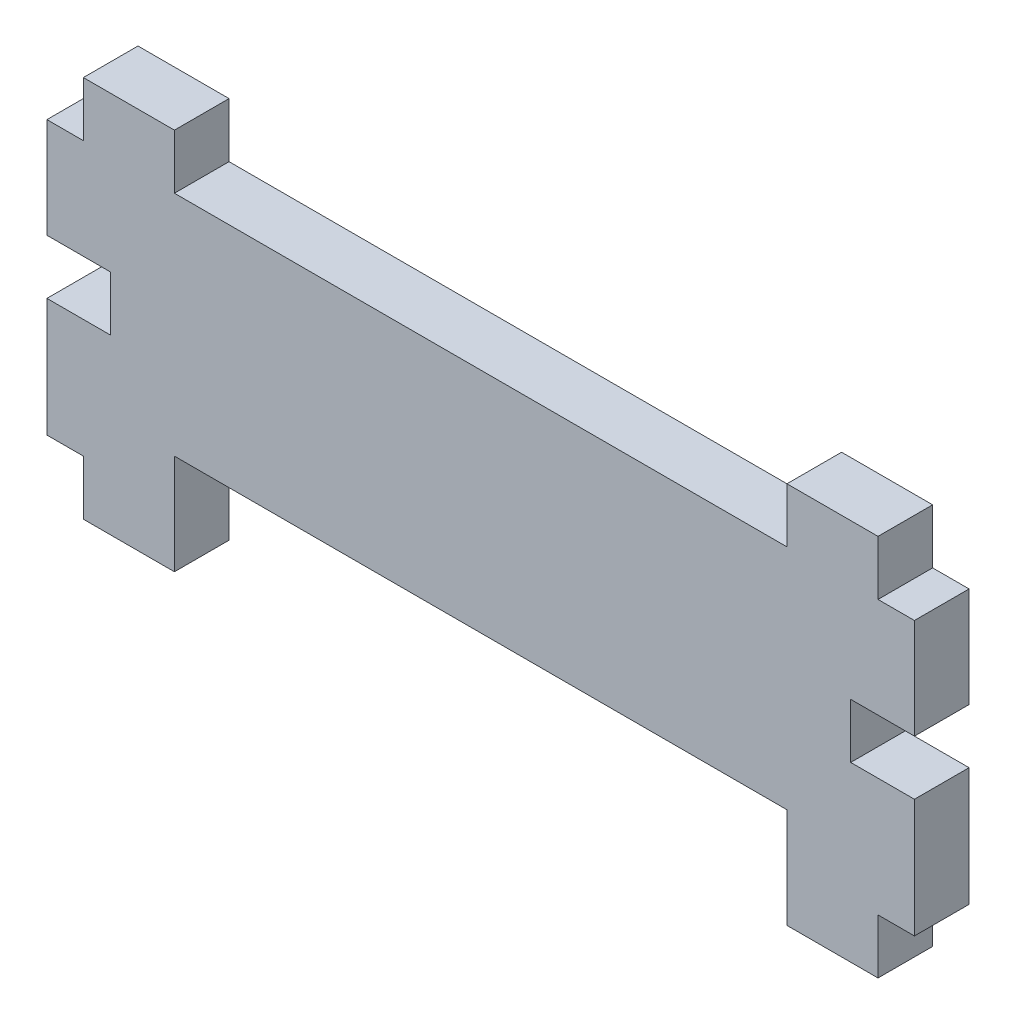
ISO-10303-21;
HEADER;
FILE_DESCRIPTION(('STEP AP214'),'2;1');
FILE_NAME('part.step','',(''),(''),'','','');
FILE_SCHEMA(('AUTOMOTIVE_DESIGN { 1 0 10303 214 1 1 1 1 }'));
ENDSEC;
DATA;
#1=APPLICATION_CONTEXT('core data for automotive mechanical design processes');
#2=APPLICATION_PROTOCOL_DEFINITION('international standard','automotive_design',2000,#1);
#3=PRODUCT_CONTEXT('',#1,'mechanical');
#4=PRODUCT('Part','Part','',(#3));
#5=PRODUCT_RELATED_PRODUCT_CATEGORY('part','',(#4));
#6=PRODUCT_DEFINITION_FORMATION('','',#4);
#7=PRODUCT_DEFINITION_CONTEXT('part definition',#1,'design');
#8=PRODUCT_DEFINITION('design','',#6,#7);
#9=PRODUCT_DEFINITION_SHAPE('','',#8);
#10=(LENGTH_UNIT() NAMED_UNIT(*) SI_UNIT(.MILLI.,.METRE.));
#11=(NAMED_UNIT(*) PLANE_ANGLE_UNIT() SI_UNIT($,.RADIAN.));
#12=(NAMED_UNIT(*) SI_UNIT($,.STERADIAN.) SOLID_ANGLE_UNIT());
#13=UNCERTAINTY_MEASURE_WITH_UNIT(LENGTH_MEASURE(1.E-05),#10,'distance_accuracy_value','');
#14=(GEOMETRIC_REPRESENTATION_CONTEXT(3) GLOBAL_UNCERTAINTY_ASSIGNED_CONTEXT((#13)) GLOBAL_UNIT_ASSIGNED_CONTEXT((#10,
#11,#12)) REPRESENTATION_CONTEXT('',''));
#15=CARTESIAN_POINT('',(0.,0.,0.));
#16=DIRECTION('',(0.,0.,1.));
#17=DIRECTION('',(1.,0.,0.));
#18=AXIS2_PLACEMENT_3D('',#15,#16,#17);
#19=CARTESIAN_POINT('',(35.0512616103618,-17.3140808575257,3.));
#20=DIRECTION('',(0.,1.,0.));
#21=DIRECTION('',(0.,0.,1.));
#22=AXIS2_PLACEMENT_3D('',#19,#20,#21);
#23=PLANE('',#22);
#24=DIRECTION('',(1.,0.,0.));
#25=VECTOR('',#24,1.);
#26=CARTESIAN_POINT('',(35.0512616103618,-17.3140808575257,0.));
#27=LINE('',#26,#25);
#28=CARTESIAN_POINT('',(33.0512616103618,-17.3140808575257,0.));
#29=VERTEX_POINT('',#28);
#30=CARTESIAN_POINT('',(35.0512616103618,-17.3140808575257,0.));
#31=VERTEX_POINT('',#30);
#32=EDGE_CURVE('E250',#29,#31,#27,.T.);
#33=ORIENTED_EDGE('',*,*,#32,.T.);
#34=DIRECTION('',(0.,0.,-1.));
#35=VECTOR('',#34,1.);
#36=CARTESIAN_POINT('',(35.0512616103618,-17.3140808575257,3.));
#37=LINE('',#36,#35);
#38=CARTESIAN_POINT('',(35.0512616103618,-17.3140808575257,3.));
#39=VERTEX_POINT('',#38);
#40=EDGE_CURVE('E11',#39,#31,#37,.T.);
#41=ORIENTED_EDGE('',*,*,#40,.F.);
#42=DIRECTION('',(1.,0.,0.));
#43=VECTOR('',#42,1.);
#44=CARTESIAN_POINT('',(35.0512616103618,-17.3140808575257,3.));
#45=LINE('',#44,#43);
#46=CARTESIAN_POINT('',(33.0512616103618,-17.3140808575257,3.));
#47=VERTEX_POINT('',#46);
#48=EDGE_CURVE('E306',#47,#39,#45,.T.);
#49=ORIENTED_EDGE('',*,*,#48,.F.);
#50=DIRECTION('',(0.,0.,-1.));
#51=VECTOR('',#50,1.);
#52=CARTESIAN_POINT('',(33.0512616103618,-17.3140808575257,3.));
#53=LINE('',#52,#51);
#54=EDGE_CURVE('E246',#47,#29,#53,.T.);
#55=ORIENTED_EDGE('',*,*,#54,.T.);
#56=EDGE_LOOP('',(#33,#41,#49,#55));
#57=FACE_BOUND('',#56,.T.);
#58=ADVANCED_FACE('F35',(#57),#23,.F.);
#59=CARTESIAN_POINT('',(35.0512616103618,-17.3140808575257,3.));
#60=DIRECTION('',(-1.,0.,0.));
#61=DIRECTION('',(0.,0.,1.));
#62=AXIS2_PLACEMENT_3D('',#59,#60,#61);
#63=PLANE('',#62);
#64=DIRECTION('',(0.,1.,0.));
#65=VECTOR('',#64,1.);
#66=CARTESIAN_POINT('',(35.0512616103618,-17.3140808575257,0.));
#67=LINE('',#66,#65);
#68=CARTESIAN_POINT('',(35.0512616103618,-10.8140808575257,0.));
#69=VERTEX_POINT('',#68);
#70=EDGE_CURVE('E253',#31,#69,#67,.T.);
#71=ORIENTED_EDGE('',*,*,#70,.T.);
#72=DIRECTION('',(0.,0.,-1.));
#73=VECTOR('',#72,1.);
#74=CARTESIAN_POINT('',(35.0512616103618,-10.8140808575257,3.));
#75=LINE('',#74,#73);
#76=CARTESIAN_POINT('',(35.0512616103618,-10.8140808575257,3.));
#77=VERTEX_POINT('',#76);
#78=EDGE_CURVE('E43',#77,#69,#75,.T.);
#79=ORIENTED_EDGE('',*,*,#78,.F.);
#80=DIRECTION('',(0.,1.,0.));
#81=VECTOR('',#80,1.);
#82=CARTESIAN_POINT('',(35.0512616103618,-17.3140808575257,3.));
#83=LINE('',#82,#81);
#84=EDGE_CURVE('E154',#39,#77,#83,.T.);
#85=ORIENTED_EDGE('',*,*,#84,.F.);
#86=ORIENTED_EDGE('',*,*,#40,.T.);
#87=EDGE_LOOP('',(#71,#79,#85,#86));
#88=FACE_BOUND('',#87,.T.);
#89=ADVANCED_FACE('F464',(#88),#63,.F.);
#90=CARTESIAN_POINT('',(35.0512616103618,-10.8140808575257,3.));
#91=DIRECTION('',(0.,-1.,0.));
#92=DIRECTION('',(0.,0.,-1.));
#93=AXIS2_PLACEMENT_3D('',#90,#91,#92);
#94=PLANE('',#93);
#95=DIRECTION('',(-1.,0.,0.));
#96=VECTOR('',#95,1.);
#97=CARTESIAN_POINT('',(35.0512616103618,-10.8140808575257,0.));
#98=LINE('',#97,#96);
#99=CARTESIAN_POINT('',(31.5512616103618,-10.8140808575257,0.));
#100=VERTEX_POINT('',#99);
#101=EDGE_CURVE('E255',#69,#100,#98,.T.);
#102=ORIENTED_EDGE('',*,*,#101,.T.);
#103=DIRECTION('',(0.,0.,-1.));
#104=VECTOR('',#103,1.);
#105=CARTESIAN_POINT('',(31.5512616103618,-10.8140808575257,3.));
#106=LINE('',#105,#104);
#107=CARTESIAN_POINT('',(31.5512616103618,-10.8140808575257,3.));
#108=VERTEX_POINT('',#107);
#109=EDGE_CURVE('E373',#108,#100,#106,.T.);
#110=ORIENTED_EDGE('',*,*,#109,.F.);
#111=DIRECTION('',(-1.,0.,0.));
#112=VECTOR('',#111,1.);
#113=CARTESIAN_POINT('',(35.0512616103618,-10.8140808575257,3.));
#114=LINE('',#113,#112);
#115=EDGE_CURVE('E381',#77,#108,#114,.T.);
#116=ORIENTED_EDGE('',*,*,#115,.F.);
#117=ORIENTED_EDGE('',*,*,#78,.T.);
#118=EDGE_LOOP('',(#102,#110,#116,#117));
#119=FACE_BOUND('',#118,.T.);
#120=ADVANCED_FACE('F379',(#119),#94,.F.);
#121=CARTESIAN_POINT('',(31.5512616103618,-10.8140808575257,3.));
#122=DIRECTION('',(-1.,0.,0.));
#123=DIRECTION('',(0.,0.,1.));
#124=AXIS2_PLACEMENT_3D('',#121,#122,#123);
#125=PLANE('',#124);
#126=DIRECTION('',(0.,1.,0.));
#127=VECTOR('',#126,1.);
#128=CARTESIAN_POINT('',(31.5512616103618,-10.8140808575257,0.));
#129=LINE('',#128,#127);
#130=CARTESIAN_POINT('',(31.5512616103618,-7.81408085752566,0.));
#131=VERTEX_POINT('',#130);
#132=EDGE_CURVE('E257',#100,#131,#129,.T.);
#133=ORIENTED_EDGE('',*,*,#132,.T.);
#134=DIRECTION('',(0.,0.,-1.));
#135=VECTOR('',#134,1.);
#136=CARTESIAN_POINT('',(31.5512616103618,-7.81408085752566,3.));
#137=LINE('',#136,#135);
#138=CARTESIAN_POINT('',(31.5512616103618,-7.81408085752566,3.));
#139=VERTEX_POINT('',#138);
#140=EDGE_CURVE('E370',#139,#131,#137,.T.);
#141=ORIENTED_EDGE('',*,*,#140,.F.);
#142=DIRECTION('',(0.,1.,0.));
#143=VECTOR('',#142,1.);
#144=CARTESIAN_POINT('',(31.5512616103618,-10.8140808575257,3.));
#145=LINE('',#144,#143);
#146=EDGE_CURVE('E399',#108,#139,#145,.T.);
#147=ORIENTED_EDGE('',*,*,#146,.F.);
#148=ORIENTED_EDGE('',*,*,#109,.T.);
#149=EDGE_LOOP('',(#133,#141,#147,#148));
#150=FACE_BOUND('',#149,.T.);
#151=ADVANCED_FACE('F390',(#150),#125,.F.);
#152=CARTESIAN_POINT('',(31.5512616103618,-7.81408085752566,3.));
#153=DIRECTION('',(0.,1.,0.));
#154=DIRECTION('',(0.,0.,1.));
#155=AXIS2_PLACEMENT_3D('',#152,#153,#154);
#156=PLANE('',#155);
#157=DIRECTION('',(1.,0.,0.));
#158=VECTOR('',#157,1.);
#159=CARTESIAN_POINT('',(31.5512616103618,-7.81408085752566,0.));
#160=LINE('',#159,#158);
#161=CARTESIAN_POINT('',(35.0512616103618,-7.81408085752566,0.));
#162=VERTEX_POINT('',#161);
#163=EDGE_CURVE('E259',#131,#162,#160,.T.);
#164=ORIENTED_EDGE('',*,*,#163,.T.);
#165=DIRECTION('',(0.,0.,-1.));
#166=VECTOR('',#165,1.);
#167=CARTESIAN_POINT('',(35.0512616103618,-7.81408085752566,3.));
#168=LINE('',#167,#166);
#169=CARTESIAN_POINT('',(35.0512616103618,-7.81408085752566,3.));
#170=VERTEX_POINT('',#169);
#171=EDGE_CURVE('E367',#170,#162,#168,.T.);
#172=ORIENTED_EDGE('',*,*,#171,.F.);
#173=DIRECTION('',(1.,0.,0.));
#174=VECTOR('',#173,1.);
#175=CARTESIAN_POINT('',(31.5512616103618,-7.81408085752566,3.));
#176=LINE('',#175,#174);
#177=EDGE_CURVE('E396',#139,#170,#176,.T.);
#178=ORIENTED_EDGE('',*,*,#177,.F.);
#179=ORIENTED_EDGE('',*,*,#140,.T.);
#180=EDGE_LOOP('',(#164,#172,#178,#179));
#181=FACE_BOUND('',#180,.T.);
#182=ADVANCED_FACE('F394',(#181),#156,.F.);
#183=CARTESIAN_POINT('',(35.0512616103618,-7.81408085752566,3.));
#184=DIRECTION('',(-1.,0.,0.));
#185=DIRECTION('',(0.,0.,1.));
#186=AXIS2_PLACEMENT_3D('',#183,#184,#185);
#187=PLANE('',#186);
#188=DIRECTION('',(0.,1.,0.));
#189=VECTOR('',#188,1.);
#190=CARTESIAN_POINT('',(35.0512616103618,-7.81408085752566,0.));
#191=LINE('',#190,#189);
#192=CARTESIAN_POINT('',(35.0512616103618,-2.31408085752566,0.));
#193=VERTEX_POINT('',#192);
#194=EDGE_CURVE('E261',#162,#193,#191,.T.);
#195=ORIENTED_EDGE('',*,*,#194,.T.);
#196=DIRECTION('',(0.,0.,-1.));
#197=VECTOR('',#196,1.);
#198=CARTESIAN_POINT('',(35.0512616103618,-2.31408085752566,3.));
#199=LINE('',#198,#197);
#200=CARTESIAN_POINT('',(35.0512616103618,-2.31408085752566,3.));
#201=VERTEX_POINT('',#200);
#202=EDGE_CURVE('E364',#201,#193,#199,.T.);
#203=ORIENTED_EDGE('',*,*,#202,.F.);
#204=DIRECTION('',(0.,1.,0.));
#205=VECTOR('',#204,1.);
#206=CARTESIAN_POINT('',(35.0512616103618,-7.81408085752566,3.));
#207=LINE('',#206,#205);
#208=EDGE_CURVE('E398',#170,#201,#207,.T.);
#209=ORIENTED_EDGE('',*,*,#208,.F.);
#210=ORIENTED_EDGE('',*,*,#171,.T.);
#211=EDGE_LOOP('',(#195,#203,#209,#210));
#212=FACE_BOUND('',#211,.T.);
#213=ADVANCED_FACE('F477',(#212),#187,.F.);
#214=CARTESIAN_POINT('',(33.0512616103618,-2.31408085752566,3.));
#215=DIRECTION('',(0.,-1.,0.));
#216=DIRECTION('',(0.,0.,-1.));
#217=AXIS2_PLACEMENT_3D('',#214,#215,#216);
#218=PLANE('',#217);
#219=DIRECTION('',(-1.,0.,0.));
#220=VECTOR('',#219,1.);
#221=CARTESIAN_POINT('',(33.0512616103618,-2.31408085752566,0.));
#222=LINE('',#221,#220);
#223=CARTESIAN_POINT('',(33.0512616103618,-2.31408085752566,0.));
#224=VERTEX_POINT('',#223);
#225=EDGE_CURVE('E263',#193,#224,#222,.T.);
#226=ORIENTED_EDGE('',*,*,#225,.T.);
#227=DIRECTION('',(0.,0.,-1.));
#228=VECTOR('',#227,1.);
#229=CARTESIAN_POINT('',(33.0512616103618,-2.31408085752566,3.));
#230=LINE('',#229,#228);
#231=CARTESIAN_POINT('',(33.0512616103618,-2.31408085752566,3.));
#232=VERTEX_POINT('',#231);
#233=EDGE_CURVE('E361',#232,#224,#230,.T.);
#234=ORIENTED_EDGE('',*,*,#233,.F.);
#235=DIRECTION('',(-1.,0.,0.));
#236=VECTOR('',#235,1.);
#237=CARTESIAN_POINT('',(33.0512616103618,-2.31408085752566,3.));
#238=LINE('',#237,#236);
#239=EDGE_CURVE('E401',#201,#232,#238,.T.);
#240=ORIENTED_EDGE('',*,*,#239,.F.);
#241=ORIENTED_EDGE('',*,*,#202,.T.);
#242=EDGE_LOOP('',(#226,#234,#240,#241));
#243=FACE_BOUND('',#242,.T.);
#244=ADVANCED_FACE('F480',(#243),#218,.F.);
#245=CARTESIAN_POINT('',(33.0512616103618,0.685919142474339,3.));
#246=DIRECTION('',(-1.,0.,0.));
#247=DIRECTION('',(0.,0.,1.));
#248=AXIS2_PLACEMENT_3D('',#245,#246,#247);
#249=PLANE('',#248);
#250=DIRECTION('',(0.,1.,0.));
#251=VECTOR('',#250,1.);
#252=CARTESIAN_POINT('',(33.0512616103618,0.685919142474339,0.));
#253=LINE('',#252,#251);
#254=CARTESIAN_POINT('',(33.0512616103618,0.685919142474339,0.));
#255=VERTEX_POINT('',#254);
#256=EDGE_CURVE('E265',#224,#255,#253,.T.);
#257=ORIENTED_EDGE('',*,*,#256,.T.);
#258=DIRECTION('',(0.,0.,-1.));
#259=VECTOR('',#258,1.);
#260=CARTESIAN_POINT('',(33.0512616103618,0.685919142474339,3.));
#261=LINE('',#260,#259);
#262=CARTESIAN_POINT('',(33.0512616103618,0.685919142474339,3.));
#263=VERTEX_POINT('',#262);
#264=EDGE_CURVE('E358',#263,#255,#261,.T.);
#265=ORIENTED_EDGE('',*,*,#264,.F.);
#266=DIRECTION('',(0.,1.,0.));
#267=VECTOR('',#266,1.);
#268=CARTESIAN_POINT('',(33.0512616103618,0.685919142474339,3.));
#269=LINE('',#268,#267);
#270=EDGE_CURVE('E407',#232,#263,#269,.T.);
#271=ORIENTED_EDGE('',*,*,#270,.F.);
#272=ORIENTED_EDGE('',*,*,#233,.T.);
#273=EDGE_LOOP('',(#257,#265,#271,#272));
#274=FACE_BOUND('',#273,.T.);
#275=ADVANCED_FACE('F484',(#274),#249,.F.);
#276=CARTESIAN_POINT('',(28.0512616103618,0.685919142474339,3.));
#277=DIRECTION('',(0.,-1.,0.));
#278=DIRECTION('',(0.,0.,-1.));
#279=AXIS2_PLACEMENT_3D('',#276,#277,#278);
#280=PLANE('',#279);
#281=DIRECTION('',(-1.,0.,0.));
#282=VECTOR('',#281,1.);
#283=CARTESIAN_POINT('',(28.0512616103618,0.685919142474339,0.));
#284=LINE('',#283,#282);
#285=CARTESIAN_POINT('',(28.0512616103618,0.685919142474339,0.));
#286=VERTEX_POINT('',#285);
#287=EDGE_CURVE('E267',#255,#286,#284,.T.);
#288=ORIENTED_EDGE('',*,*,#287,.T.);
#289=DIRECTION('',(0.,0.,-1.));
#290=VECTOR('',#289,1.);
#291=CARTESIAN_POINT('',(28.0512616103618,0.685919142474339,3.));
#292=LINE('',#291,#290);
#293=CARTESIAN_POINT('',(28.0512616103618,0.685919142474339,3.));
#294=VERTEX_POINT('',#293);
#295=EDGE_CURVE('E355',#294,#286,#292,.T.);
#296=ORIENTED_EDGE('',*,*,#295,.F.);
#297=DIRECTION('',(-1.,0.,0.));
#298=VECTOR('',#297,1.);
#299=CARTESIAN_POINT('',(28.0512616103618,0.685919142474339,3.));
#300=LINE('',#299,#298);
#301=EDGE_CURVE('E409',#263,#294,#300,.T.);
#302=ORIENTED_EDGE('',*,*,#301,.F.);
#303=ORIENTED_EDGE('',*,*,#264,.T.);
#304=EDGE_LOOP('',(#288,#296,#302,#303));
#305=FACE_BOUND('',#304,.T.);
#306=ADVANCED_FACE('F488',(#305),#280,.F.);
#307=CARTESIAN_POINT('',(28.0512616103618,-2.31408085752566,3.));
#308=DIRECTION('',(1.,0.,0.));
#309=DIRECTION('',(0.,0.,-1.));
#310=AXIS2_PLACEMENT_3D('',#307,#308,#309);
#311=PLANE('',#310);
#312=DIRECTION('',(0.,-1.,0.));
#313=VECTOR('',#312,1.);
#314=CARTESIAN_POINT('',(28.0512616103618,-2.31408085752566,0.));
#315=LINE('',#314,#313);
#316=CARTESIAN_POINT('',(28.0512616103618,-2.31408085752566,0.));
#317=VERTEX_POINT('',#316);
#318=EDGE_CURVE('E269',#286,#317,#315,.T.);
#319=ORIENTED_EDGE('',*,*,#318,.T.);
#320=DIRECTION('',(0.,0.,-1.));
#321=VECTOR('',#320,1.);
#322=CARTESIAN_POINT('',(28.0512616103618,-2.31408085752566,3.));
#323=LINE('',#322,#321);
#324=CARTESIAN_POINT('',(28.0512616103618,-2.31408085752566,3.));
#325=VERTEX_POINT('',#324);
#326=EDGE_CURVE('E352',#325,#317,#323,.T.);
#327=ORIENTED_EDGE('',*,*,#326,.F.);
#328=DIRECTION('',(0.,-1.,0.));
#329=VECTOR('',#328,1.);
#330=CARTESIAN_POINT('',(28.0512616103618,-2.31408085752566,3.));
#331=LINE('',#330,#329);
#332=EDGE_CURVE('E411',#294,#325,#331,.T.);
#333=ORIENTED_EDGE('',*,*,#332,.F.);
#334=ORIENTED_EDGE('',*,*,#295,.T.);
#335=EDGE_LOOP('',(#319,#327,#333,#334));
#336=FACE_BOUND('',#335,.T.);
#337=ADVANCED_FACE('F492',(#336),#311,.F.);
#338=CARTESIAN_POINT('',(28.0512616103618,-2.31408085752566,3.));
#339=DIRECTION('',(0.,-1.,0.));
#340=DIRECTION('',(0.,0.,-1.));
#341=AXIS2_PLACEMENT_3D('',#338,#339,#340);
#342=PLANE('',#341);
#343=DIRECTION('',(-1.,0.,0.));
#344=VECTOR('',#343,1.);
#345=CARTESIAN_POINT('',(28.0512616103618,-2.31408085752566,0.));
#346=LINE('',#345,#344);
#347=CARTESIAN_POINT('',(-5.57873838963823,-2.31408085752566,0.));
#348=VERTEX_POINT('',#347);
#349=EDGE_CURVE('E271',#317,#348,#346,.T.);
#350=ORIENTED_EDGE('',*,*,#349,.T.);
#351=DIRECTION('',(0.,0.,-1.));
#352=VECTOR('',#351,1.);
#353=CARTESIAN_POINT('',(-5.57873838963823,-2.31408085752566,3.));
#354=LINE('',#353,#352);
#355=CARTESIAN_POINT('',(-5.57873838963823,-2.31408085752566,3.));
#356=VERTEX_POINT('',#355);
#357=EDGE_CURVE('E349',#356,#348,#354,.T.);
#358=ORIENTED_EDGE('',*,*,#357,.F.);
#359=DIRECTION('',(-1.,0.,0.));
#360=VECTOR('',#359,1.);
#361=CARTESIAN_POINT('',(28.0512616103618,-2.31408085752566,3.));
#362=LINE('',#361,#360);
#363=EDGE_CURVE('E413',#325,#356,#362,.T.);
#364=ORIENTED_EDGE('',*,*,#363,.F.);
#365=ORIENTED_EDGE('',*,*,#326,.T.);
#366=EDGE_LOOP('',(#350,#358,#364,#365));
#367=FACE_BOUND('',#366,.T.);
#368=ADVANCED_FACE('F496',(#367),#342,.F.);
#369=CARTESIAN_POINT('',(-5.57873838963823,0.685919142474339,3.));
#370=DIRECTION('',(-1.,0.,0.));
#371=DIRECTION('',(0.,0.,1.));
#372=AXIS2_PLACEMENT_3D('',#369,#370,#371);
#373=PLANE('',#372);
#374=DIRECTION('',(0.,1.,0.));
#375=VECTOR('',#374,1.);
#376=CARTESIAN_POINT('',(-5.57873838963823,0.685919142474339,0.));
#377=LINE('',#376,#375);
#378=CARTESIAN_POINT('',(-5.57873838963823,0.685919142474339,0.));
#379=VERTEX_POINT('',#378);
#380=EDGE_CURVE('E273',#348,#379,#377,.T.);
#381=ORIENTED_EDGE('',*,*,#380,.T.);
#382=DIRECTION('',(0.,0.,-1.));
#383=VECTOR('',#382,1.);
#384=CARTESIAN_POINT('',(-5.57873838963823,0.685919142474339,3.));
#385=LINE('',#384,#383);
#386=CARTESIAN_POINT('',(-5.57873838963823,0.685919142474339,3.));
#387=VERTEX_POINT('',#386);
#388=EDGE_CURVE('E346',#387,#379,#385,.T.);
#389=ORIENTED_EDGE('',*,*,#388,.F.);
#390=DIRECTION('',(0.,1.,0.));
#391=VECTOR('',#390,1.);
#392=CARTESIAN_POINT('',(-5.57873838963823,0.685919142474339,3.));
#393=LINE('',#392,#391);
#394=EDGE_CURVE('E415',#356,#387,#393,.T.);
#395=ORIENTED_EDGE('',*,*,#394,.F.);
#396=ORIENTED_EDGE('',*,*,#357,.T.);
#397=EDGE_LOOP('',(#381,#389,#395,#396));
#398=FACE_BOUND('',#397,.T.);
#399=ADVANCED_FACE('F500',(#398),#373,.F.);
#400=CARTESIAN_POINT('',(-10.5787383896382,0.685919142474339,3.));
#401=DIRECTION('',(0.,-1.,0.));
#402=DIRECTION('',(0.,0.,-1.));
#403=AXIS2_PLACEMENT_3D('',#400,#401,#402);
#404=PLANE('',#403);
#405=DIRECTION('',(-1.,0.,0.));
#406=VECTOR('',#405,1.);
#407=CARTESIAN_POINT('',(-10.5787383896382,0.685919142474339,0.));
#408=LINE('',#407,#406);
#409=CARTESIAN_POINT('',(-10.5787383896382,0.685919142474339,0.));
#410=VERTEX_POINT('',#409);
#411=EDGE_CURVE('E275',#379,#410,#408,.T.);
#412=ORIENTED_EDGE('',*,*,#411,.T.);
#413=DIRECTION('',(0.,0.,-1.));
#414=VECTOR('',#413,1.);
#415=CARTESIAN_POINT('',(-10.5787383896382,0.685919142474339,3.));
#416=LINE('',#415,#414);
#417=CARTESIAN_POINT('',(-10.5787383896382,0.685919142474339,3.));
#418=VERTEX_POINT('',#417);
#419=EDGE_CURVE('E343',#418,#410,#416,.T.);
#420=ORIENTED_EDGE('',*,*,#419,.F.);
#421=DIRECTION('',(-1.,0.,0.));
#422=VECTOR('',#421,1.);
#423=CARTESIAN_POINT('',(-10.5787383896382,0.685919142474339,3.));
#424=LINE('',#423,#422);
#425=EDGE_CURVE('E417',#387,#418,#424,.T.);
#426=ORIENTED_EDGE('',*,*,#425,.F.);
#427=ORIENTED_EDGE('',*,*,#388,.T.);
#428=EDGE_LOOP('',(#412,#420,#426,#427));
#429=FACE_BOUND('',#428,.T.);
#430=ADVANCED_FACE('F504',(#429),#404,.F.);
#431=CARTESIAN_POINT('',(-10.5787383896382,-2.31408085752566,3.));
#432=DIRECTION('',(1.,0.,0.));
#433=DIRECTION('',(0.,0.,-1.));
#434=AXIS2_PLACEMENT_3D('',#431,#432,#433);
#435=PLANE('',#434);
#436=DIRECTION('',(0.,-1.,0.));
#437=VECTOR('',#436,1.);
#438=CARTESIAN_POINT('',(-10.5787383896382,-2.31408085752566,0.));
#439=LINE('',#438,#437);
#440=CARTESIAN_POINT('',(-10.5787383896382,-2.31408085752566,0.));
#441=VERTEX_POINT('',#440);
#442=EDGE_CURVE('E277',#410,#441,#439,.T.);
#443=ORIENTED_EDGE('',*,*,#442,.T.);
#444=DIRECTION('',(0.,0.,-1.));
#445=VECTOR('',#444,1.);
#446=CARTESIAN_POINT('',(-10.5787383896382,-2.31408085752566,3.));
#447=LINE('',#446,#445);
#448=CARTESIAN_POINT('',(-10.5787383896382,-2.31408085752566,3.));
#449=VERTEX_POINT('',#448);
#450=EDGE_CURVE('E340',#449,#441,#447,.T.);
#451=ORIENTED_EDGE('',*,*,#450,.F.);
#452=DIRECTION('',(0.,-1.,0.));
#453=VECTOR('',#452,1.);
#454=CARTESIAN_POINT('',(-10.5787383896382,-2.31408085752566,3.));
#455=LINE('',#454,#453);
#456=EDGE_CURVE('E419',#418,#449,#455,.T.);
#457=ORIENTED_EDGE('',*,*,#456,.F.);
#458=ORIENTED_EDGE('',*,*,#419,.T.);
#459=EDGE_LOOP('',(#443,#451,#457,#458));
#460=FACE_BOUND('',#459,.T.);
#461=ADVANCED_FACE('F508',(#460),#435,.F.);
#462=CARTESIAN_POINT('',(-10.5787383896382,-2.31408085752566,3.));
#463=DIRECTION('',(0.,-1.,0.));
#464=DIRECTION('',(0.,0.,-1.));
#465=AXIS2_PLACEMENT_3D('',#462,#463,#464);
#466=PLANE('',#465);
#467=DIRECTION('',(-1.,0.,0.));
#468=VECTOR('',#467,1.);
#469=CARTESIAN_POINT('',(-10.5787383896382,-2.31408085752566,0.));
#470=LINE('',#469,#468);
#471=CARTESIAN_POINT('',(-12.5787383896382,-2.31408085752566,0.));
#472=VERTEX_POINT('',#471);
#473=EDGE_CURVE('E279',#441,#472,#470,.T.);
#474=ORIENTED_EDGE('',*,*,#473,.T.);
#475=DIRECTION('',(0.,0.,-1.));
#476=VECTOR('',#475,1.);
#477=CARTESIAN_POINT('',(-12.5787383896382,-2.31408085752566,3.));
#478=LINE('',#477,#476);
#479=CARTESIAN_POINT('',(-12.5787383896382,-2.31408085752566,3.));
#480=VERTEX_POINT('',#479);
#481=EDGE_CURVE('E337',#480,#472,#478,.T.);
#482=ORIENTED_EDGE('',*,*,#481,.F.);
#483=DIRECTION('',(-1.,0.,0.));
#484=VECTOR('',#483,1.);
#485=CARTESIAN_POINT('',(-10.5787383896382,-2.31408085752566,3.));
#486=LINE('',#485,#484);
#487=EDGE_CURVE('E421',#449,#480,#486,.T.);
#488=ORIENTED_EDGE('',*,*,#487,.F.);
#489=ORIENTED_EDGE('',*,*,#450,.T.);
#490=EDGE_LOOP('',(#474,#482,#488,#489));
#491=FACE_BOUND('',#490,.T.);
#492=ADVANCED_FACE('F512',(#491),#466,.F.);
#493=CARTESIAN_POINT('',(-12.5787383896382,-7.81408085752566,3.));
#494=DIRECTION('',(1.,0.,0.));
#495=DIRECTION('',(0.,0.,-1.));
#496=AXIS2_PLACEMENT_3D('',#493,#494,#495);
#497=PLANE('',#496);
#498=DIRECTION('',(0.,-1.,0.));
#499=VECTOR('',#498,1.);
#500=CARTESIAN_POINT('',(-12.5787383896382,-7.81408085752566,0.));
#501=LINE('',#500,#499);
#502=CARTESIAN_POINT('',(-12.5787383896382,-7.81408085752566,0.));
#503=VERTEX_POINT('',#502);
#504=EDGE_CURVE('E281',#472,#503,#501,.T.);
#505=ORIENTED_EDGE('',*,*,#504,.T.);
#506=DIRECTION('',(0.,0.,-1.));
#507=VECTOR('',#506,1.);
#508=CARTESIAN_POINT('',(-12.5787383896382,-7.81408085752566,3.));
#509=LINE('',#508,#507);
#510=CARTESIAN_POINT('',(-12.5787383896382,-7.81408085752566,3.));
#511=VERTEX_POINT('',#510);
#512=EDGE_CURVE('E334',#511,#503,#509,.T.);
#513=ORIENTED_EDGE('',*,*,#512,.F.);
#514=DIRECTION('',(0.,-1.,0.));
#515=VECTOR('',#514,1.);
#516=CARTESIAN_POINT('',(-12.5787383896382,-7.81408085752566,3.));
#517=LINE('',#516,#515);
#518=EDGE_CURVE('E423',#480,#511,#517,.T.);
#519=ORIENTED_EDGE('',*,*,#518,.F.);
#520=ORIENTED_EDGE('',*,*,#481,.T.);
#521=EDGE_LOOP('',(#505,#513,#519,#520));
#522=FACE_BOUND('',#521,.T.);
#523=ADVANCED_FACE('F516',(#522),#497,.F.);
#524=CARTESIAN_POINT('',(-9.07873838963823,-7.81408085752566,3.));
#525=DIRECTION('',(0.,1.,0.));
#526=DIRECTION('',(0.,0.,1.));
#527=AXIS2_PLACEMENT_3D('',#524,#525,#526);
#528=PLANE('',#527);
#529=DIRECTION('',(1.,0.,0.));
#530=VECTOR('',#529,1.);
#531=CARTESIAN_POINT('',(-9.07873838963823,-7.81408085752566,0.));
#532=LINE('',#531,#530);
#533=CARTESIAN_POINT('',(-9.07873838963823,-7.81408085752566,0.));
#534=VERTEX_POINT('',#533);
#535=EDGE_CURVE('E283',#503,#534,#532,.T.);
#536=ORIENTED_EDGE('',*,*,#535,.T.);
#537=DIRECTION('',(0.,0.,-1.));
#538=VECTOR('',#537,1.);
#539=CARTESIAN_POINT('',(-9.07873838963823,-7.81408085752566,3.));
#540=LINE('',#539,#538);
#541=CARTESIAN_POINT('',(-9.07873838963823,-7.81408085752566,3.));
#542=VERTEX_POINT('',#541);
#543=EDGE_CURVE('E331',#542,#534,#540,.T.);
#544=ORIENTED_EDGE('',*,*,#543,.F.);
#545=DIRECTION('',(1.,0.,0.));
#546=VECTOR('',#545,1.);
#547=CARTESIAN_POINT('',(-9.07873838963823,-7.81408085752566,3.));
#548=LINE('',#547,#546);
#549=EDGE_CURVE('E425',#511,#542,#548,.T.);
#550=ORIENTED_EDGE('',*,*,#549,.F.);
#551=ORIENTED_EDGE('',*,*,#512,.T.);
#552=EDGE_LOOP('',(#536,#544,#550,#551));
#553=FACE_BOUND('',#552,.T.);
#554=ADVANCED_FACE('F520',(#553),#528,.F.);
#555=CARTESIAN_POINT('',(-9.07873838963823,-10.8140808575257,3.));
#556=DIRECTION('',(1.,0.,0.));
#557=DIRECTION('',(0.,0.,-1.));
#558=AXIS2_PLACEMENT_3D('',#555,#556,#557);
#559=PLANE('',#558);
#560=DIRECTION('',(0.,-1.,0.));
#561=VECTOR('',#560,1.);
#562=CARTESIAN_POINT('',(-9.07873838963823,-10.8140808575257,0.));
#563=LINE('',#562,#561);
#564=CARTESIAN_POINT('',(-9.07873838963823,-10.8140808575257,0.));
#565=VERTEX_POINT('',#564);
#566=EDGE_CURVE('E285',#534,#565,#563,.T.);
#567=ORIENTED_EDGE('',*,*,#566,.T.);
#568=DIRECTION('',(0.,0.,-1.));
#569=VECTOR('',#568,1.);
#570=CARTESIAN_POINT('',(-9.07873838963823,-10.8140808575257,3.));
#571=LINE('',#570,#569);
#572=CARTESIAN_POINT('',(-9.07873838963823,-10.8140808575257,3.));
#573=VERTEX_POINT('',#572);
#574=EDGE_CURVE('E328',#573,#565,#571,.T.);
#575=ORIENTED_EDGE('',*,*,#574,.F.);
#576=DIRECTION('',(0.,-1.,0.));
#577=VECTOR('',#576,1.);
#578=CARTESIAN_POINT('',(-9.07873838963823,-10.8140808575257,3.));
#579=LINE('',#578,#577);
#580=EDGE_CURVE('E427',#542,#573,#579,.T.);
#581=ORIENTED_EDGE('',*,*,#580,.F.);
#582=ORIENTED_EDGE('',*,*,#543,.T.);
#583=EDGE_LOOP('',(#567,#575,#581,#582));
#584=FACE_BOUND('',#583,.T.);
#585=ADVANCED_FACE('F524',(#584),#559,.F.);
#586=CARTESIAN_POINT('',(-12.5787383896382,-10.8140808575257,3.));
#587=DIRECTION('',(0.,-1.,0.));
#588=DIRECTION('',(0.,0.,-1.));
#589=AXIS2_PLACEMENT_3D('',#586,#587,#588);
#590=PLANE('',#589);
#591=DIRECTION('',(-1.,0.,0.));
#592=VECTOR('',#591,1.);
#593=CARTESIAN_POINT('',(-12.5787383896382,-10.8140808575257,0.));
#594=LINE('',#593,#592);
#595=CARTESIAN_POINT('',(-12.5787383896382,-10.8140808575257,0.));
#596=VERTEX_POINT('',#595);
#597=EDGE_CURVE('E287',#565,#596,#594,.T.);
#598=ORIENTED_EDGE('',*,*,#597,.T.);
#599=DIRECTION('',(0.,0.,-1.));
#600=VECTOR('',#599,1.);
#601=CARTESIAN_POINT('',(-12.5787383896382,-10.8140808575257,3.));
#602=LINE('',#601,#600);
#603=CARTESIAN_POINT('',(-12.5787383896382,-10.8140808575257,3.));
#604=VERTEX_POINT('',#603);
#605=EDGE_CURVE('E325',#604,#596,#602,.T.);
#606=ORIENTED_EDGE('',*,*,#605,.F.);
#607=DIRECTION('',(-1.,0.,0.));
#608=VECTOR('',#607,1.);
#609=CARTESIAN_POINT('',(-12.5787383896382,-10.8140808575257,3.));
#610=LINE('',#609,#608);
#611=EDGE_CURVE('E429',#573,#604,#610,.T.);
#612=ORIENTED_EDGE('',*,*,#611,.F.);
#613=ORIENTED_EDGE('',*,*,#574,.T.);
#614=EDGE_LOOP('',(#598,#606,#612,#613));
#615=FACE_BOUND('',#614,.T.);
#616=ADVANCED_FACE('F528',(#615),#590,.F.);
#617=CARTESIAN_POINT('',(-12.5787383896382,-17.3140808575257,3.));
#618=DIRECTION('',(1.,0.,0.));
#619=DIRECTION('',(0.,1.,0.));
#620=AXIS2_PLACEMENT_3D('',#617,#618,#619);
#621=PLANE('',#620);
#622=DIRECTION('',(0.,-1.,0.));
#623=VECTOR('',#622,1.);
#624=CARTESIAN_POINT('',(-12.5787383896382,-17.3140808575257,0.));
#625=LINE('',#624,#623);
#626=CARTESIAN_POINT('',(-12.5787383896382,-17.3140808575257,0.));
#627=VERTEX_POINT('',#626);
#628=EDGE_CURVE('E289',#596,#627,#625,.T.);
#629=ORIENTED_EDGE('',*,*,#628,.T.);
#630=DIRECTION('',(0.,0.,-1.));
#631=VECTOR('',#630,1.);
#632=CARTESIAN_POINT('',(-12.5787383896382,-17.3140808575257,3.));
#633=LINE('',#632,#631);
#634=CARTESIAN_POINT('',(-12.5787383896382,-17.3140808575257,3.));
#635=VERTEX_POINT('',#634);
#636=EDGE_CURVE('E322',#635,#627,#633,.T.);
#637=ORIENTED_EDGE('',*,*,#636,.F.);
#638=DIRECTION('',(0.,-1.,0.));
#639=VECTOR('',#638,1.);
#640=CARTESIAN_POINT('',(-12.5787383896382,-17.3140808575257,3.));
#641=LINE('',#640,#639);
#642=EDGE_CURVE('E431',#604,#635,#641,.T.);
#643=ORIENTED_EDGE('',*,*,#642,.F.);
#644=ORIENTED_EDGE('',*,*,#605,.T.);
#645=EDGE_LOOP('',(#629,#637,#643,#644));
#646=FACE_BOUND('',#645,.T.);
#647=ADVANCED_FACE('F532',(#646),#621,.F.);
#648=CARTESIAN_POINT('',(-12.5787383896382,-17.3140808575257,3.));
#649=DIRECTION('',(0.,1.,0.));
#650=DIRECTION('',(0.,0.,1.));
#651=AXIS2_PLACEMENT_3D('',#648,#649,#650);
#652=PLANE('',#651);
#653=DIRECTION('',(1.,0.,0.));
#654=VECTOR('',#653,1.);
#655=CARTESIAN_POINT('',(-12.5787383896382,-17.3140808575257,0.));
#656=LINE('',#655,#654);
#657=CARTESIAN_POINT('',(-10.5787383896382,-17.3140808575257,0.));
#658=VERTEX_POINT('',#657);
#659=EDGE_CURVE('E291',#627,#658,#656,.T.);
#660=ORIENTED_EDGE('',*,*,#659,.T.);
#661=DIRECTION('',(0.,0.,-1.));
#662=VECTOR('',#661,1.);
#663=CARTESIAN_POINT('',(-10.5787383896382,-17.3140808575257,3.));
#664=LINE('',#663,#662);
#665=CARTESIAN_POINT('',(-10.5787383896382,-17.3140808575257,3.));
#666=VERTEX_POINT('',#665);
#667=EDGE_CURVE('E319',#666,#658,#664,.T.);
#668=ORIENTED_EDGE('',*,*,#667,.F.);
#669=DIRECTION('',(1.,0.,0.));
#670=VECTOR('',#669,1.);
#671=CARTESIAN_POINT('',(-12.5787383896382,-17.3140808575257,3.));
#672=LINE('',#671,#670);
#673=EDGE_CURVE('E433',#635,#666,#672,.T.);
#674=ORIENTED_EDGE('',*,*,#673,.F.);
#675=ORIENTED_EDGE('',*,*,#636,.T.);
#676=EDGE_LOOP('',(#660,#668,#674,#675));
#677=FACE_BOUND('',#676,.T.);
#678=ADVANCED_FACE('F536',(#677),#652,.F.);
#679=CARTESIAN_POINT('',(-10.5787383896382,-17.3140808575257,3.));
#680=DIRECTION('',(1.,0.,0.));
#681=DIRECTION('',(0.,0.,-1.));
#682=AXIS2_PLACEMENT_3D('',#679,#680,#681);
#683=PLANE('',#682);
#684=DIRECTION('',(0.,-1.,0.));
#685=VECTOR('',#684,1.);
#686=CARTESIAN_POINT('',(-10.5787383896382,-17.3140808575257,0.));
#687=LINE('',#686,#685);
#688=CARTESIAN_POINT('',(-10.5787383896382,-20.3140808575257,0.));
#689=VERTEX_POINT('',#688);
#690=EDGE_CURVE('E293',#658,#689,#687,.T.);
#691=ORIENTED_EDGE('',*,*,#690,.T.);
#692=DIRECTION('',(0.,0.,-1.));
#693=VECTOR('',#692,1.);
#694=CARTESIAN_POINT('',(-10.5787383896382,-20.3140808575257,3.));
#695=LINE('',#694,#693);
#696=CARTESIAN_POINT('',(-10.5787383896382,-20.3140808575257,3.));
#697=VERTEX_POINT('',#696);
#698=EDGE_CURVE('E316',#697,#689,#695,.T.);
#699=ORIENTED_EDGE('',*,*,#698,.F.);
#700=DIRECTION('',(0.,-1.,0.));
#701=VECTOR('',#700,1.);
#702=CARTESIAN_POINT('',(-10.5787383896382,-17.3140808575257,3.));
#703=LINE('',#702,#701);
#704=EDGE_CURVE('E435',#666,#697,#703,.T.);
#705=ORIENTED_EDGE('',*,*,#704,.F.);
#706=ORIENTED_EDGE('',*,*,#667,.T.);
#707=EDGE_LOOP('',(#691,#699,#705,#706));
#708=FACE_BOUND('',#707,.T.);
#709=ADVANCED_FACE('F540',(#708),#683,.F.);
#710=CARTESIAN_POINT('',(-10.5787383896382,-20.3140808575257,3.));
#711=DIRECTION('',(0.,1.,0.));
#712=DIRECTION('',(0.,0.,1.));
#713=AXIS2_PLACEMENT_3D('',#710,#711,#712);
#714=PLANE('',#713);
#715=DIRECTION('',(1.,0.,0.));
#716=VECTOR('',#715,1.);
#717=CARTESIAN_POINT('',(-10.5787383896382,-20.3140808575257,0.));
#718=LINE('',#717,#716);
#719=CARTESIAN_POINT('',(-5.57873838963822,-20.3140808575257,0.));
#720=VERTEX_POINT('',#719);
#721=EDGE_CURVE('E295',#689,#720,#718,.T.);
#722=ORIENTED_EDGE('',*,*,#721,.T.);
#723=DIRECTION('',(0.,0.,-1.));
#724=VECTOR('',#723,1.);
#725=CARTESIAN_POINT('',(-5.57873838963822,-20.3140808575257,3.));
#726=LINE('',#725,#724);
#727=CARTESIAN_POINT('',(-5.57873838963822,-20.3140808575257,3.));
#728=VERTEX_POINT('',#727);
#729=EDGE_CURVE('E313',#728,#720,#726,.T.);
#730=ORIENTED_EDGE('',*,*,#729,.F.);
#731=DIRECTION('',(1.,0.,0.));
#732=VECTOR('',#731,1.);
#733=CARTESIAN_POINT('',(-10.5787383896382,-20.3140808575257,3.));
#734=LINE('',#733,#732);
#735=EDGE_CURVE('E437',#697,#728,#734,.T.);
#736=ORIENTED_EDGE('',*,*,#735,.F.);
#737=ORIENTED_EDGE('',*,*,#698,.T.);
#738=EDGE_LOOP('',(#722,#730,#736,#737));
#739=FACE_BOUND('',#738,.T.);
#740=ADVANCED_FACE('F544',(#739),#714,.F.);
#741=CARTESIAN_POINT('',(-5.57873838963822,-17.3140808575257,3.));
#742=DIRECTION('',(-1.,0.,0.));
#743=DIRECTION('',(0.,0.,1.));
#744=AXIS2_PLACEMENT_3D('',#741,#742,#743);
#745=PLANE('',#744);
#746=DIRECTION('',(0.,1.,0.));
#747=VECTOR('',#746,1.);
#748=CARTESIAN_POINT('',(-5.57873838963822,-17.3140808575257,0.));
#749=LINE('',#748,#747);
#750=CARTESIAN_POINT('',(-5.57873838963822,-14.8140808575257,0.));
#751=VERTEX_POINT('',#750);
#752=EDGE_CURVE('E298',#720,#751,#749,.T.);
#753=ORIENTED_EDGE('',*,*,#752,.T.);
#754=DIRECTION('',(0.,0.,-1.));
#755=VECTOR('',#754,1.);
#756=CARTESIAN_POINT('',(-5.57873838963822,-14.8140808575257,3.));
#757=LINE('',#756,#755);
#758=CARTESIAN_POINT('',(-5.57873838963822,-14.8140808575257,3.));
#759=VERTEX_POINT('',#758);
#760=EDGE_CURVE('E310',#759,#751,#757,.T.);
#761=ORIENTED_EDGE('',*,*,#760,.F.);
#762=DIRECTION('',(0.,1.,0.));
#763=VECTOR('',#762,1.);
#764=CARTESIAN_POINT('',(-5.57873838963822,-20.3140808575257,3.));
#765=LINE('',#764,#763);
#766=EDGE_CURVE('E439',#728,#759,#765,.T.);
#767=ORIENTED_EDGE('',*,*,#766,.F.);
#768=ORIENTED_EDGE('',*,*,#729,.T.);
#769=EDGE_LOOP('',(#753,#761,#767,#768));
#770=FACE_BOUND('',#769,.T.);
#771=ADVANCED_FACE('F445',(#770),#745,.F.);
#772=CARTESIAN_POINT('',(28.0512616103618,-14.8140808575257,3.));
#773=DIRECTION('',(0.,1.,0.));
#774=DIRECTION('',(0.,0.,1.));
#775=AXIS2_PLACEMENT_3D('',#772,#773,#774);
#776=PLANE('',#775);
#777=DIRECTION('',(1.,0.,0.));
#778=VECTOR('',#777,1.);
#779=CARTESIAN_POINT('',(28.0512616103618,-14.8140808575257,0.));
#780=LINE('',#779,#778);
#781=CARTESIAN_POINT('',(28.0512616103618,-14.8140808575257,0.));
#782=VERTEX_POINT('',#781);
#783=EDGE_CURVE('E300',#751,#782,#780,.T.);
#784=ORIENTED_EDGE('',*,*,#783,.T.);
#785=DIRECTION('',(0.,0.,-1.));
#786=VECTOR('',#785,1.);
#787=CARTESIAN_POINT('',(28.0512616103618,-14.8140808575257,3.));
#788=LINE('',#787,#786);
#789=CARTESIAN_POINT('',(28.0512616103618,-14.8140808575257,3.));
#790=VERTEX_POINT('',#789);
#791=EDGE_CURVE('E241',#790,#782,#788,.T.);
#792=ORIENTED_EDGE('',*,*,#791,.F.);
#793=DIRECTION('',(1.,0.,0.));
#794=VECTOR('',#793,1.);
#795=CARTESIAN_POINT('',(28.0512616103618,-14.8140808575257,3.));
#796=LINE('',#795,#794);
#797=EDGE_CURVE('E233',#759,#790,#796,.T.);
#798=ORIENTED_EDGE('',*,*,#797,.F.);
#799=ORIENTED_EDGE('',*,*,#760,.T.);
#800=EDGE_LOOP('',(#784,#792,#798,#799));
#801=FACE_BOUND('',#800,.T.);
#802=ADVANCED_FACE('F448',(#801),#776,.F.);
#803=CARTESIAN_POINT('',(28.0512616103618,-17.3140808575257,3.));
#804=DIRECTION('',(1.,0.,0.));
#805=DIRECTION('',(0.,0.,-1.));
#806=AXIS2_PLACEMENT_3D('',#803,#804,#805);
#807=PLANE('',#806);
#808=DIRECTION('',(0.,-1.,0.));
#809=VECTOR('',#808,1.);
#810=CARTESIAN_POINT('',(28.0512616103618,-17.3140808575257,0.));
#811=LINE('',#810,#809);
#812=CARTESIAN_POINT('',(28.0512616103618,-20.3140808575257,0.));
#813=VERTEX_POINT('',#812);
#814=EDGE_CURVE('E240',#782,#813,#811,.T.);
#815=ORIENTED_EDGE('',*,*,#814,.T.);
#816=DIRECTION('',(0.,0.,-1.));
#817=VECTOR('',#816,1.);
#818=CARTESIAN_POINT('',(28.0512616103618,-20.3140808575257,3.));
#819=LINE('',#818,#817);
#820=CARTESIAN_POINT('',(28.0512616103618,-20.3140808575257,3.));
#821=VERTEX_POINT('',#820);
#822=EDGE_CURVE('E238',#821,#813,#819,.T.);
#823=ORIENTED_EDGE('',*,*,#822,.F.);
#824=DIRECTION('',(0.,-1.,0.));
#825=VECTOR('',#824,1.);
#826=CARTESIAN_POINT('',(28.0512616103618,-17.3140808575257,3.));
#827=LINE('',#826,#825);
#828=EDGE_CURVE('E227',#790,#821,#827,.T.);
#829=ORIENTED_EDGE('',*,*,#828,.F.);
#830=ORIENTED_EDGE('',*,*,#791,.T.);
#831=EDGE_LOOP('',(#815,#823,#829,#830));
#832=FACE_BOUND('',#831,.T.);
#833=ADVANCED_FACE('F239',(#832),#807,.F.);
#834=CARTESIAN_POINT('',(28.0512616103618,-20.3140808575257,3.));
#835=DIRECTION('',(0.,1.,0.));
#836=DIRECTION('',(0.,0.,1.));
#837=AXIS2_PLACEMENT_3D('',#834,#835,#836);
#838=PLANE('',#837);
#839=DIRECTION('',(1.,0.,0.));
#840=VECTOR('',#839,1.);
#841=CARTESIAN_POINT('',(28.0512616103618,-20.3140808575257,0.));
#842=LINE('',#841,#840);
#843=CARTESIAN_POINT('',(33.0512616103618,-20.3140808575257,0.));
#844=VERTEX_POINT('',#843);
#845=EDGE_CURVE('E140',#813,#844,#842,.T.);
#846=ORIENTED_EDGE('',*,*,#845,.T.);
#847=DIRECTION('',(0.,0.,-1.));
#848=VECTOR('',#847,1.);
#849=CARTESIAN_POINT('',(33.0512616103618,-20.3140808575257,3.));
#850=LINE('',#849,#848);
#851=CARTESIAN_POINT('',(33.0512616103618,-20.3140808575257,3.));
#852=VERTEX_POINT('',#851);
#853=EDGE_CURVE('E242',#852,#844,#850,.T.);
#854=ORIENTED_EDGE('',*,*,#853,.F.);
#855=DIRECTION('',(1.,0.,0.));
#856=VECTOR('',#855,1.);
#857=CARTESIAN_POINT('',(28.0512616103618,-20.3140808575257,3.));
#858=LINE('',#857,#856);
#859=EDGE_CURVE('E231',#821,#852,#858,.T.);
#860=ORIENTED_EDGE('',*,*,#859,.F.);
#861=ORIENTED_EDGE('',*,*,#822,.T.);
#862=EDGE_LOOP('',(#846,#854,#860,#861));
#863=FACE_BOUND('',#862,.T.);
#864=ADVANCED_FACE('F244',(#863),#838,.F.);
#865=CARTESIAN_POINT('',(33.0512616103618,-20.3140808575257,3.));
#866=DIRECTION('',(-1.,0.,0.));
#867=DIRECTION('',(0.,0.,1.));
#868=AXIS2_PLACEMENT_3D('',#865,#866,#867);
#869=PLANE('',#868);
#870=DIRECTION('',(0.,1.,0.));
#871=VECTOR('',#870,1.);
#872=CARTESIAN_POINT('',(33.0512616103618,-20.3140808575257,0.));
#873=LINE('',#872,#871);
#874=EDGE_CURVE('E146',#844,#29,#873,.T.);
#875=ORIENTED_EDGE('',*,*,#874,.T.);
#876=ORIENTED_EDGE('',*,*,#54,.F.);
#877=DIRECTION('',(0.,1.,0.));
#878=VECTOR('',#877,1.);
#879=CARTESIAN_POINT('',(33.0512616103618,-20.3140808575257,3.));
#880=LINE('',#879,#878);
#881=EDGE_CURVE('E51',#852,#47,#880,.T.);
#882=ORIENTED_EDGE('',*,*,#881,.F.);
#883=ORIENTED_EDGE('',*,*,#853,.T.);
#884=EDGE_LOOP('',(#875,#876,#882,#883));
#885=FACE_BOUND('',#884,.T.);
#886=ADVANCED_FACE('F453',(#885),#869,.F.);
#887=CARTESIAN_POINT('',(0.,0.,3.));
#888=DIRECTION('',(0.,0.,-1.));
#889=DIRECTION('',(-1.,0.,0.));
#890=AXIS2_PLACEMENT_3D('',#887,#888,#889);
#891=PLANE('',#890);
#892=ORIENTED_EDGE('',*,*,#48,.T.);
#893=ORIENTED_EDGE('',*,*,#84,.T.);
#894=ORIENTED_EDGE('',*,*,#115,.T.);
#895=ORIENTED_EDGE('',*,*,#146,.T.);
#896=ORIENTED_EDGE('',*,*,#177,.T.);
#897=ORIENTED_EDGE('',*,*,#208,.T.);
#898=ORIENTED_EDGE('',*,*,#239,.T.);
#899=ORIENTED_EDGE('',*,*,#270,.T.);
#900=ORIENTED_EDGE('',*,*,#301,.T.);
#901=ORIENTED_EDGE('',*,*,#332,.T.);
#902=ORIENTED_EDGE('',*,*,#363,.T.);
#903=ORIENTED_EDGE('',*,*,#394,.T.);
#904=ORIENTED_EDGE('',*,*,#425,.T.);
#905=ORIENTED_EDGE('',*,*,#456,.T.);
#906=ORIENTED_EDGE('',*,*,#487,.T.);
#907=ORIENTED_EDGE('',*,*,#518,.T.);
#908=ORIENTED_EDGE('',*,*,#549,.T.);
#909=ORIENTED_EDGE('',*,*,#580,.T.);
#910=ORIENTED_EDGE('',*,*,#611,.T.);
#911=ORIENTED_EDGE('',*,*,#642,.T.);
#912=ORIENTED_EDGE('',*,*,#673,.T.);
#913=ORIENTED_EDGE('',*,*,#704,.T.);
#914=ORIENTED_EDGE('',*,*,#735,.T.);
#915=ORIENTED_EDGE('',*,*,#766,.T.);
#916=ORIENTED_EDGE('',*,*,#797,.T.);
#917=ORIENTED_EDGE('',*,*,#828,.T.);
#918=ORIENTED_EDGE('',*,*,#859,.T.);
#919=ORIENTED_EDGE('',*,*,#881,.T.);
#920=EDGE_LOOP('',(#892,#893,#894,#895,#896,#897,#898,#899,#900,#901,#902,#903,#904,#905,#906,
#907,#908,#909,#910,#911,#912,#913,#914,#915,#916,#917,#918,#919));
#921=FACE_BOUND('',#920,.T.);
#922=ADVANCED_FACE('F229',(#921),#891,.F.);
#923=CARTESIAN_POINT('',(0.,0.,0.));
#924=DIRECTION('',(0.,0.,-1.));
#925=DIRECTION('',(-1.,0.,0.));
#926=AXIS2_PLACEMENT_3D('',#923,#924,#925);
#927=PLANE('',#926);
#928=ORIENTED_EDGE('',*,*,#32,.F.);
#929=ORIENTED_EDGE('',*,*,#874,.F.);
#930=ORIENTED_EDGE('',*,*,#845,.F.);
#931=ORIENTED_EDGE('',*,*,#814,.F.);
#932=ORIENTED_EDGE('',*,*,#783,.F.);
#933=ORIENTED_EDGE('',*,*,#752,.F.);
#934=ORIENTED_EDGE('',*,*,#721,.F.);
#935=ORIENTED_EDGE('',*,*,#690,.F.);
#936=ORIENTED_EDGE('',*,*,#659,.F.);
#937=ORIENTED_EDGE('',*,*,#628,.F.);
#938=ORIENTED_EDGE('',*,*,#597,.F.);
#939=ORIENTED_EDGE('',*,*,#566,.F.);
#940=ORIENTED_EDGE('',*,*,#535,.F.);
#941=ORIENTED_EDGE('',*,*,#504,.F.);
#942=ORIENTED_EDGE('',*,*,#473,.F.);
#943=ORIENTED_EDGE('',*,*,#442,.F.);
#944=ORIENTED_EDGE('',*,*,#411,.F.);
#945=ORIENTED_EDGE('',*,*,#380,.F.);
#946=ORIENTED_EDGE('',*,*,#349,.F.);
#947=ORIENTED_EDGE('',*,*,#318,.F.);
#948=ORIENTED_EDGE('',*,*,#287,.F.);
#949=ORIENTED_EDGE('',*,*,#256,.F.);
#950=ORIENTED_EDGE('',*,*,#225,.F.);
#951=ORIENTED_EDGE('',*,*,#194,.F.);
#952=ORIENTED_EDGE('',*,*,#163,.F.);
#953=ORIENTED_EDGE('',*,*,#132,.F.);
#954=ORIENTED_EDGE('',*,*,#101,.F.);
#955=ORIENTED_EDGE('',*,*,#70,.F.);
#956=EDGE_LOOP('',(#928,#929,#930,#931,#932,#933,#934,#935,#936,#937,#938,#939,#940,#941,#942,
#943,#944,#945,#946,#947,#948,#949,#950,#951,#952,#953,#954,#955));
#957=FACE_BOUND('',#956,.T.);
#958=ADVANCED_FACE('F385',(#957),#927,.T.);
#959=CLOSED_SHELL('',(#58,#89,#120,#151,#182,#213,#244,#275,#306,#337,#368,#399,#430,#461,#492,
#523,#554,#585,#616,#647,#678,#709,#740,#771,#802,#833,#864,#886,#922,#958));
#960=MANIFOLD_SOLID_BREP('B2',#959);
#961=ADVANCED_BREP_SHAPE_REPRESENTATION('',(#18,#960),#14);
#962=SHAPE_DEFINITION_REPRESENTATION(#9,#961);
ENDSEC;
END-ISO-10303-21;
